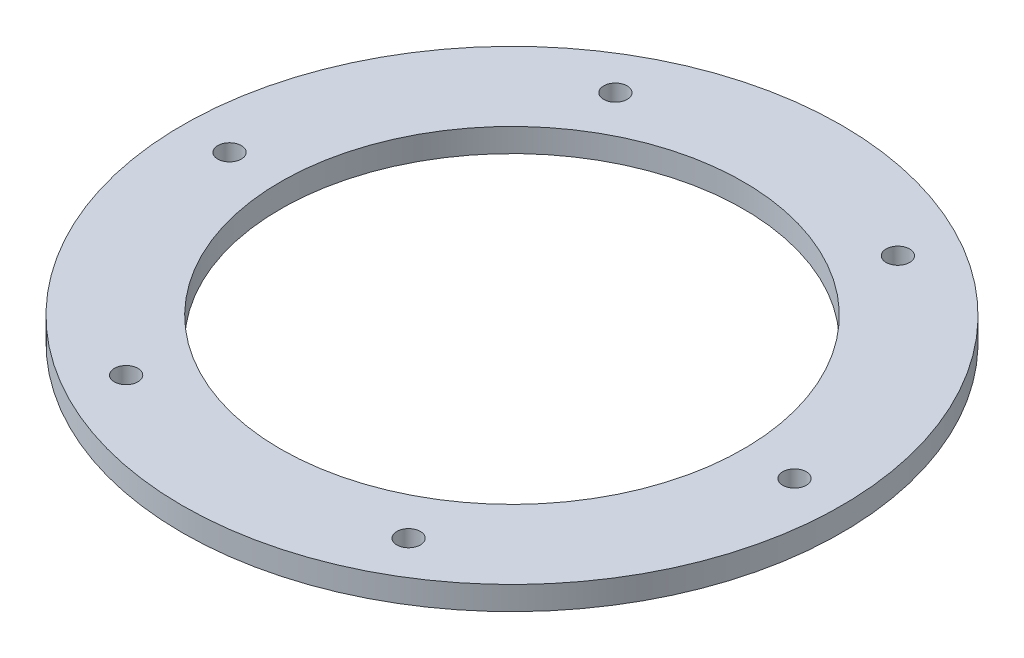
ISO-10303-21;
HEADER;
FILE_DESCRIPTION(('STEP AP214'),'2;1');
FILE_NAME('part.step','',(''),(''),'','','');
FILE_SCHEMA(('AUTOMOTIVE_DESIGN { 1 0 10303 214 1 1 1 1 }'));
ENDSEC;
DATA;
#1=APPLICATION_CONTEXT('core data for automotive mechanical design processes');
#2=APPLICATION_PROTOCOL_DEFINITION('international standard','automotive_design',2000,#1);
#3=PRODUCT_CONTEXT('',#1,'mechanical');
#4=PRODUCT('Part','Part','',(#3));
#5=PRODUCT_RELATED_PRODUCT_CATEGORY('part','',(#4));
#6=PRODUCT_DEFINITION_FORMATION('','',#4);
#7=PRODUCT_DEFINITION_CONTEXT('part definition',#1,'design');
#8=PRODUCT_DEFINITION('design','',#6,#7);
#9=PRODUCT_DEFINITION_SHAPE('','',#8);
#10=(LENGTH_UNIT() NAMED_UNIT(*) SI_UNIT(.MILLI.,.METRE.));
#11=(NAMED_UNIT(*) PLANE_ANGLE_UNIT() SI_UNIT($,.RADIAN.));
#12=(NAMED_UNIT(*) SI_UNIT($,.STERADIAN.) SOLID_ANGLE_UNIT());
#13=UNCERTAINTY_MEASURE_WITH_UNIT(LENGTH_MEASURE(1.E-05),#10,'distance_accuracy_value','');
#14=(GEOMETRIC_REPRESENTATION_CONTEXT(3) GLOBAL_UNCERTAINTY_ASSIGNED_CONTEXT((#13)) GLOBAL_UNIT_ASSIGNED_CONTEXT((#10,
#11,#12)) REPRESENTATION_CONTEXT('',''));
#15=CARTESIAN_POINT('',(0.,0.,0.));
#16=DIRECTION('',(0.,0.,1.));
#17=DIRECTION('',(1.,0.,0.));
#18=AXIS2_PLACEMENT_3D('',#15,#16,#17);
#19=CARTESIAN_POINT('',(0.,3.,0.));
#20=DIRECTION('',(0.,1.,0.));
#21=DIRECTION('',(0.,0.,1.));
#22=AXIS2_PLACEMENT_3D('',#19,#20,#21);
#23=PLANE('',#22);
#24=CARTESIAN_POINT('',(18.0000000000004,3.,31.1769145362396));
#25=DIRECTION('',(0.,1.,0.));
#26=DIRECTION('',(-0.866025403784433,0.,0.50000000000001));
#27=AXIS2_PLACEMENT_3D('',#24,#25,#26);
#28=CIRCLE('',#27,1.5);
#29=CARTESIAN_POINT('',(18.0000000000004,3.,32.6769145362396));
#30=VERTEX_POINT('',#29);
#31=EDGE_CURVE('E72',#30,#30,#28,.T.);
#32=ORIENTED_EDGE('',*,*,#31,.F.);
#33=EDGE_LOOP('',(#32));
#34=FACE_BOUND('',#33,.T.);
#35=CARTESIAN_POINT('',(-17.9999999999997,3.,31.17691453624));
#36=DIRECTION('',(0.,1.,0.));
#37=DIRECTION('',(-0.866025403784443,0.,-0.499999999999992));
#38=AXIS2_PLACEMENT_3D('',#35,#36,#37);
#39=CIRCLE('',#38,1.5);
#40=CARTESIAN_POINT('',(-17.9999999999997,3.,32.67691453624));
#41=VERTEX_POINT('',#40);
#42=EDGE_CURVE('E71',#41,#41,#39,.T.);
#43=ORIENTED_EDGE('',*,*,#42,.F.);
#44=EDGE_LOOP('',(#43));
#45=FACE_BOUND('',#44,.T.);
#46=CARTESIAN_POINT('',(-36.,3.,0.));
#47=DIRECTION('',(0.,1.,0.));
#48=DIRECTION('',(0.,0.,-1.));
#49=AXIS2_PLACEMENT_3D('',#46,#47,#48);
#50=CIRCLE('',#49,1.5);
#51=CARTESIAN_POINT('',(-36.,3.,1.5));
#52=VERTEX_POINT('',#51);
#53=EDGE_CURVE('E78',#52,#52,#50,.T.);
#54=ORIENTED_EDGE('',*,*,#53,.F.);
#55=EDGE_LOOP('',(#54));
#56=FACE_BOUND('',#55,.T.);
#57=CARTESIAN_POINT('',(-18.0000000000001,3.,-31.1769145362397));
#58=DIRECTION('',(0.,1.,0.));
#59=DIRECTION('',(0.866025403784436,0.,-0.500000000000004));
#60=AXIS2_PLACEMENT_3D('',#57,#58,#59);
#61=CIRCLE('',#60,1.5);
#62=CARTESIAN_POINT('',(-18.0000000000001,3.,-29.6769145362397));
#63=VERTEX_POINT('',#62);
#64=EDGE_CURVE('E84',#63,#63,#61,.T.);
#65=ORIENTED_EDGE('',*,*,#64,.F.);
#66=EDGE_LOOP('',(#65));
#67=FACE_BOUND('',#66,.T.);
#68=CARTESIAN_POINT('',(17.9999999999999,3.,-31.1769145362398));
#69=DIRECTION('',(0.,1.,0.));
#70=DIRECTION('',(0.86602540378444,0.,0.499999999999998));
#71=AXIS2_PLACEMENT_3D('',#68,#69,#70);
#72=CIRCLE('',#71,1.5);
#73=CARTESIAN_POINT('',(17.9999999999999,3.,-29.6769145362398));
#74=VERTEX_POINT('',#73);
#75=EDGE_CURVE('E64',#74,#74,#72,.T.);
#76=ORIENTED_EDGE('',*,*,#75,.F.);
#77=EDGE_LOOP('',(#76));
#78=FACE_BOUND('',#77,.T.);
#79=CARTESIAN_POINT('',(36.,3.,0.));
#80=DIRECTION('',(0.,1.,0.));
#81=DIRECTION('',(0.,0.,1.));
#82=AXIS2_PLACEMENT_3D('',#79,#80,#81);
#83=CIRCLE('',#82,1.5);
#84=CARTESIAN_POINT('',(36.,3.,1.5));
#85=VERTEX_POINT('',#84);
#86=EDGE_CURVE('E58',#85,#85,#83,.T.);
#87=ORIENTED_EDGE('',*,*,#86,.F.);
#88=EDGE_LOOP('',(#87));
#89=FACE_BOUND('',#88,.T.);
#90=CARTESIAN_POINT('',(0.,3.,0.));
#91=DIRECTION('',(0.,1.,0.));
#92=DIRECTION('',(0.,0.,1.));
#93=AXIS2_PLACEMENT_3D('',#90,#91,#92);
#94=CIRCLE('',#93,42.);
#95=CARTESIAN_POINT('',(0.,3.,42.));
#96=VERTEX_POINT('',#95);
#97=EDGE_CURVE('E10',#96,#96,#94,.T.);
#98=ORIENTED_EDGE('',*,*,#97,.T.);
#99=EDGE_LOOP('',(#98));
#100=FACE_BOUND('',#99,.T.);
#101=CARTESIAN_POINT('',(0.,3.,0.));
#102=DIRECTION('',(0.,1.,0.));
#103=DIRECTION('',(0.,0.,1.));
#104=AXIS2_PLACEMENT_3D('',#101,#102,#103);
#105=CIRCLE('',#104,29.5);
#106=CARTESIAN_POINT('',(0.,3.,29.5));
#107=VERTEX_POINT('',#106);
#108=EDGE_CURVE('E48',#107,#107,#105,.T.);
#109=ORIENTED_EDGE('',*,*,#108,.F.);
#110=EDGE_LOOP('',(#109));
#111=FACE_BOUND('',#110,.T.);
#112=ADVANCED_FACE('F37',(#34,#45,#56,#67,#78,#89,#100,#111),#23,.T.);
#113=CARTESIAN_POINT('',(0.,0.,0.));
#114=DIRECTION('',(0.,1.,0.));
#115=DIRECTION('',(0.,0.,1.));
#116=AXIS2_PLACEMENT_3D('',#113,#114,#115);
#117=PLANE('',#116);
#118=CARTESIAN_POINT('',(18.0000000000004,0.,31.1769145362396));
#119=DIRECTION('',(0.,1.,0.));
#120=DIRECTION('',(0.,0.,1.));
#121=AXIS2_PLACEMENT_3D('',#118,#119,#120);
#122=CIRCLE('',#121,1.5);
#123=CARTESIAN_POINT('',(18.0000000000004,0.,32.6769145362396));
#124=VERTEX_POINT('',#123);
#125=EDGE_CURVE('E68',#124,#124,#122,.F.);
#126=ORIENTED_EDGE('',*,*,#125,.F.);
#127=EDGE_LOOP('',(#126));
#128=FACE_BOUND('',#127,.T.);
#129=CARTESIAN_POINT('',(-17.9999999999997,0.,31.17691453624));
#130=DIRECTION('',(0.,1.,0.));
#131=DIRECTION('',(0.,0.,1.));
#132=AXIS2_PLACEMENT_3D('',#129,#130,#131);
#133=CIRCLE('',#132,1.5);
#134=CARTESIAN_POINT('',(-17.9999999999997,0.,32.67691453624));
#135=VERTEX_POINT('',#134);
#136=EDGE_CURVE('E75',#135,#135,#133,.F.);
#137=ORIENTED_EDGE('',*,*,#136,.F.);
#138=EDGE_LOOP('',(#137));
#139=FACE_BOUND('',#138,.T.);
#140=CARTESIAN_POINT('',(-36.,0.,0.));
#141=DIRECTION('',(0.,1.,0.));
#142=DIRECTION('',(0.,0.,1.));
#143=AXIS2_PLACEMENT_3D('',#140,#141,#142);
#144=CIRCLE('',#143,1.5);
#145=CARTESIAN_POINT('',(-36.,0.,1.5));
#146=VERTEX_POINT('',#145);
#147=EDGE_CURVE('E81',#146,#146,#144,.F.);
#148=ORIENTED_EDGE('',*,*,#147,.F.);
#149=EDGE_LOOP('',(#148));
#150=FACE_BOUND('',#149,.T.);
#151=CARTESIAN_POINT('',(-18.0000000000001,0.,-31.1769145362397));
#152=DIRECTION('',(0.,1.,0.));
#153=DIRECTION('',(0.,0.,1.));
#154=AXIS2_PLACEMENT_3D('',#151,#152,#153);
#155=CIRCLE('',#154,1.5);
#156=CARTESIAN_POINT('',(-18.0000000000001,0.,-29.6769145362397));
#157=VERTEX_POINT('',#156);
#158=EDGE_CURVE('E67',#157,#157,#155,.F.);
#159=ORIENTED_EDGE('',*,*,#158,.F.);
#160=EDGE_LOOP('',(#159));
#161=FACE_BOUND('',#160,.T.);
#162=CARTESIAN_POINT('',(17.9999999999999,0.,-31.1769145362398));
#163=DIRECTION('',(0.,1.,0.));
#164=DIRECTION('',(0.,0.,1.));
#165=AXIS2_PLACEMENT_3D('',#162,#163,#164);
#166=CIRCLE('',#165,1.5);
#167=CARTESIAN_POINT('',(17.9999999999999,0.,-29.6769145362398));
#168=VERTEX_POINT('',#167);
#169=EDGE_CURVE('E61',#168,#168,#166,.F.);
#170=ORIENTED_EDGE('',*,*,#169,.F.);
#171=EDGE_LOOP('',(#170));
#172=FACE_BOUND('',#171,.T.);
#173=CARTESIAN_POINT('',(36.,0.,0.));
#174=DIRECTION('',(0.,1.,0.));
#175=DIRECTION('',(0.,0.,1.));
#176=AXIS2_PLACEMENT_3D('',#173,#174,#175);
#177=CIRCLE('',#176,1.5);
#178=CARTESIAN_POINT('',(36.,0.,1.5));
#179=VERTEX_POINT('',#178);
#180=EDGE_CURVE('E53',#179,#179,#177,.F.);
#181=ORIENTED_EDGE('',*,*,#180,.F.);
#182=EDGE_LOOP('',(#181));
#183=FACE_BOUND('',#182,.T.);
#184=CARTESIAN_POINT('',(0.,0.,0.));
#185=DIRECTION('',(0.,1.,0.));
#186=DIRECTION('',(0.,0.,1.));
#187=AXIS2_PLACEMENT_3D('',#184,#185,#186);
#188=CIRCLE('',#187,42.);
#189=CARTESIAN_POINT('',(0.,0.,42.));
#190=VERTEX_POINT('',#189);
#191=EDGE_CURVE('E41',#190,#190,#188,.T.);
#192=ORIENTED_EDGE('',*,*,#191,.F.);
#193=EDGE_LOOP('',(#192));
#194=FACE_BOUND('',#193,.T.);
#195=CARTESIAN_POINT('',(0.,0.,0.));
#196=DIRECTION('',(0.,1.,0.));
#197=DIRECTION('',(0.,0.,1.));
#198=AXIS2_PLACEMENT_3D('',#195,#196,#197);
#199=CIRCLE('',#198,29.5);
#200=CARTESIAN_POINT('',(0.,0.,29.5));
#201=VERTEX_POINT('',#200);
#202=EDGE_CURVE('E50',#201,#201,#199,.T.);
#203=ORIENTED_EDGE('',*,*,#202,.T.);
#204=EDGE_LOOP('',(#203));
#205=FACE_BOUND('',#204,.T.);
#206=ADVANCED_FACE('F97',(#128,#139,#150,#161,#172,#183,#194,#205),#117,.F.);
#207=CARTESIAN_POINT('',(0.,3.,0.));
#208=DIRECTION('',(0.,-1.,0.));
#209=DIRECTION('',(0.,0.,-1.));
#210=AXIS2_PLACEMENT_3D('',#207,#208,#209);
#211=CYLINDRICAL_SURFACE('',#210,42.);
#212=ORIENTED_EDGE('',*,*,#97,.F.);
#213=EDGE_LOOP('',(#212));
#214=FACE_BOUND('',#213,.T.);
#215=ORIENTED_EDGE('',*,*,#191,.T.);
#216=EDGE_LOOP('',(#215));
#217=FACE_BOUND('',#216,.T.);
#218=ADVANCED_FACE('F39',(#214,#217),#211,.T.);
#219=CARTESIAN_POINT('',(0.,3.,0.));
#220=DIRECTION('',(0.,-1.,0.));
#221=DIRECTION('',(0.,0.,-1.));
#222=AXIS2_PLACEMENT_3D('',#219,#220,#221);
#223=CYLINDRICAL_SURFACE('',#222,29.5);
#224=ORIENTED_EDGE('',*,*,#108,.T.);
#225=EDGE_LOOP('',(#224));
#226=FACE_BOUND('',#225,.T.);
#227=ORIENTED_EDGE('',*,*,#202,.F.);
#228=EDGE_LOOP('',(#227));
#229=FACE_BOUND('',#228,.T.);
#230=ADVANCED_FACE('F106',(#226,#229),#223,.F.);
#231=CARTESIAN_POINT('',(36.,-0.00100000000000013,0.));
#232=DIRECTION('',(0.,1.,0.));
#233=DIRECTION('',(0.,0.,1.));
#234=AXIS2_PLACEMENT_3D('',#231,#232,#233);
#235=CYLINDRICAL_SURFACE('',#234,1.5);
#236=CARTESIAN_POINT('',(36.,3.,1.5));
#237=CARTESIAN_POINT('',(36.,2.96875,1.5));
#238=CARTESIAN_POINT('',(36.,2.9375,1.5));
#239=CARTESIAN_POINT('',(36.,2.875,1.5));
#240=CARTESIAN_POINT('',(36.,2.84375,1.5));
#241=CARTESIAN_POINT('',(36.,2.78125,1.5));
#242=CARTESIAN_POINT('',(36.,2.75,1.5));
#243=CARTESIAN_POINT('',(36.,2.6875,1.5));
#244=CARTESIAN_POINT('',(36.,2.65625,1.5));
#245=CARTESIAN_POINT('',(36.,2.59375,1.5));
#246=CARTESIAN_POINT('',(36.,2.5625,1.5));
#247=CARTESIAN_POINT('',(36.,2.5,1.5));
#248=CARTESIAN_POINT('',(36.,2.46875,1.5));
#249=CARTESIAN_POINT('',(36.,2.40625,1.5));
#250=CARTESIAN_POINT('',(36.,2.375,1.5));
#251=CARTESIAN_POINT('',(36.,2.3125,1.5));
#252=CARTESIAN_POINT('',(36.,2.28125,1.5));
#253=CARTESIAN_POINT('',(36.,2.21875,1.5));
#254=CARTESIAN_POINT('',(36.,2.1875,1.5));
#255=CARTESIAN_POINT('',(36.,2.125,1.5));
#256=CARTESIAN_POINT('',(36.,2.09375,1.5));
#257=CARTESIAN_POINT('',(36.,2.03125,1.5));
#258=CARTESIAN_POINT('',(36.,2.,1.5));
#259=CARTESIAN_POINT('',(36.,1.9375,1.5));
#260=CARTESIAN_POINT('',(36.,1.90625,1.5));
#261=CARTESIAN_POINT('',(36.,1.84375,1.5));
#262=CARTESIAN_POINT('',(36.,1.8125,1.5));
#263=CARTESIAN_POINT('',(36.,1.75,1.5));
#264=CARTESIAN_POINT('',(36.,1.71875,1.5));
#265=CARTESIAN_POINT('',(36.,1.65625,1.5));
#266=CARTESIAN_POINT('',(36.,1.625,1.5));
#267=CARTESIAN_POINT('',(36.,1.5625,1.5));
#268=CARTESIAN_POINT('',(36.,1.53125,1.5));
#269=CARTESIAN_POINT('',(36.,1.46875,1.5));
#270=CARTESIAN_POINT('',(36.,1.4375,1.5));
#271=CARTESIAN_POINT('',(36.,1.375,1.5));
#272=CARTESIAN_POINT('',(36.,1.34375,1.5));
#273=CARTESIAN_POINT('',(36.,1.28125,1.5));
#274=CARTESIAN_POINT('',(36.,1.25,1.5));
#275=CARTESIAN_POINT('',(36.,1.1875,1.5));
#276=CARTESIAN_POINT('',(36.,1.15625,1.5));
#277=CARTESIAN_POINT('',(36.,1.09375,1.5));
#278=CARTESIAN_POINT('',(36.,1.0625,1.5));
#279=CARTESIAN_POINT('',(36.,1.,1.5));
#280=CARTESIAN_POINT('',(36.,0.96875,1.5));
#281=CARTESIAN_POINT('',(36.,0.90625,1.5));
#282=CARTESIAN_POINT('',(36.,0.875,1.5));
#283=CARTESIAN_POINT('',(36.,0.8125,1.5));
#284=CARTESIAN_POINT('',(36.,0.78125,1.5));
#285=CARTESIAN_POINT('',(36.,0.71875,1.5));
#286=CARTESIAN_POINT('',(36.,0.6875,1.5));
#287=CARTESIAN_POINT('',(36.,0.625,1.5));
#288=CARTESIAN_POINT('',(36.,0.59375,1.5));
#289=CARTESIAN_POINT('',(36.,0.53125,1.5));
#290=CARTESIAN_POINT('',(36.,0.5,1.5));
#291=CARTESIAN_POINT('',(36.,0.4375,1.5));
#292=CARTESIAN_POINT('',(36.,0.40625,1.5));
#293=CARTESIAN_POINT('',(36.,0.34375,1.5));
#294=CARTESIAN_POINT('',(36.,0.3125,1.5));
#295=CARTESIAN_POINT('',(36.,0.25,1.5));
#296=CARTESIAN_POINT('',(36.,0.21875,1.5));
#297=CARTESIAN_POINT('',(36.,0.15625,1.5));
#298=CARTESIAN_POINT('',(36.,0.125,1.5));
#299=CARTESIAN_POINT('',(36.,0.0625000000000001,1.5));
#300=CARTESIAN_POINT('',(36.,0.0312500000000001,1.5));
#301=CARTESIAN_POINT('',(36.,0.,1.5));
#302=B_SPLINE_CURVE_WITH_KNOTS('',3,(#236,#237,#238,#239,#240,#241,#242,#243,#244,#245,#246,
#247,#248,#249,#250,#251,#252,#253,#254,#255,#256,#257,#258,#259,#260,#261,#262,#263,#264,#265,
#266,#267,#268,#269,#270,#271,#272,#273,#274,#275,#276,#277,#278,#279,#280,#281,#282,#283,#284,
#285,#286,#287,#288,#289,#290,#291,#292,#293,#294,#295,#296,#297,#298,#299,#300,#301),
.UNSPECIFIED.,.F.,.F.,(4,2,2,2,2,2,2,2,2,2,2,2,2,2,2,2,2,2,2,2,2,2,2,2,2,2,2,2,2,2,2,2,4),(0.,
0.0937500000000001,0.1875,0.28125,0.375,0.46875,0.5625,0.65625,0.75,0.84375,0.9375,1.03125,
1.125,1.21875,1.3125,1.40625,1.5,1.59375,1.6875,1.78125,1.875,1.96875,2.0625,2.15625,2.25,
2.34375,2.4375,2.53125,2.625,2.71875,2.8125,2.90625,3.),.UNSPECIFIED.);
#303=EDGE_CURVE('BSEAM109',#85,#179,#302,.T.);
#304=ORIENTED_EDGE('',*,*,#86,.T.);
#305=ORIENTED_EDGE('',*,*,#180,.T.);
#306=ORIENTED_EDGE('',*,*,#303,.T.);
#307=ORIENTED_EDGE('',*,*,#303,.F.);
#308=EDGE_LOOP('',(#304,#306,#305,#307));
#309=FACE_BOUND('',#308,.T.);
#310=ADVANCED_FACE('F109',(#309),#235,.F.);
#311=CARTESIAN_POINT('',(17.9999999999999,-0.00100000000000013,-31.1769145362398));
#312=DIRECTION('',(0.,1.,0.));
#313=DIRECTION('',(0.,0.,1.));
#314=AXIS2_PLACEMENT_3D('',#311,#312,#313);
#315=CYLINDRICAL_SURFACE('',#314,1.5);
#316=CARTESIAN_POINT('',(17.9999999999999,3.,-29.6769145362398));
#317=CARTESIAN_POINT('',(17.9999999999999,2.96875,-29.6769145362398));
#318=CARTESIAN_POINT('',(17.9999999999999,2.9375,-29.6769145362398));
#319=CARTESIAN_POINT('',(17.9999999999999,2.875,-29.6769145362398));
#320=CARTESIAN_POINT('',(17.9999999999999,2.84375,-29.6769145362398));
#321=CARTESIAN_POINT('',(17.9999999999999,2.78125,-29.6769145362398));
#322=CARTESIAN_POINT('',(17.9999999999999,2.75,-29.6769145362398));
#323=CARTESIAN_POINT('',(17.9999999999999,2.6875,-29.6769145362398));
#324=CARTESIAN_POINT('',(17.9999999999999,2.65625,-29.6769145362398));
#325=CARTESIAN_POINT('',(17.9999999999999,2.59375,-29.6769145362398));
#326=CARTESIAN_POINT('',(17.9999999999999,2.5625,-29.6769145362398));
#327=CARTESIAN_POINT('',(17.9999999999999,2.5,-29.6769145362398));
#328=CARTESIAN_POINT('',(17.9999999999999,2.46875,-29.6769145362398));
#329=CARTESIAN_POINT('',(17.9999999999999,2.40625,-29.6769145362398));
#330=CARTESIAN_POINT('',(17.9999999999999,2.375,-29.6769145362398));
#331=CARTESIAN_POINT('',(17.9999999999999,2.3125,-29.6769145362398));
#332=CARTESIAN_POINT('',(17.9999999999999,2.28125,-29.6769145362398));
#333=CARTESIAN_POINT('',(17.9999999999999,2.21875,-29.6769145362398));
#334=CARTESIAN_POINT('',(17.9999999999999,2.1875,-29.6769145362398));
#335=CARTESIAN_POINT('',(17.9999999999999,2.125,-29.6769145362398));
#336=CARTESIAN_POINT('',(17.9999999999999,2.09375,-29.6769145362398));
#337=CARTESIAN_POINT('',(17.9999999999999,2.03125,-29.6769145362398));
#338=CARTESIAN_POINT('',(17.9999999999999,2.,-29.6769145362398));
#339=CARTESIAN_POINT('',(17.9999999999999,1.9375,-29.6769145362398));
#340=CARTESIAN_POINT('',(17.9999999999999,1.90625,-29.6769145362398));
#341=CARTESIAN_POINT('',(17.9999999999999,1.84375,-29.6769145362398));
#342=CARTESIAN_POINT('',(17.9999999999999,1.8125,-29.6769145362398));
#343=CARTESIAN_POINT('',(17.9999999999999,1.75,-29.6769145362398));
#344=CARTESIAN_POINT('',(17.9999999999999,1.71875,-29.6769145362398));
#345=CARTESIAN_POINT('',(17.9999999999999,1.65625,-29.6769145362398));
#346=CARTESIAN_POINT('',(17.9999999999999,1.625,-29.6769145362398));
#347=CARTESIAN_POINT('',(17.9999999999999,1.5625,-29.6769145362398));
#348=CARTESIAN_POINT('',(17.9999999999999,1.53125,-29.6769145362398));
#349=CARTESIAN_POINT('',(17.9999999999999,1.46875,-29.6769145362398));
#350=CARTESIAN_POINT('',(17.9999999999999,1.4375,-29.6769145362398));
#351=CARTESIAN_POINT('',(17.9999999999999,1.375,-29.6769145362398));
#352=CARTESIAN_POINT('',(17.9999999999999,1.34375,-29.6769145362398));
#353=CARTESIAN_POINT('',(17.9999999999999,1.28125,-29.6769145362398));
#354=CARTESIAN_POINT('',(17.9999999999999,1.25,-29.6769145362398));
#355=CARTESIAN_POINT('',(17.9999999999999,1.1875,-29.6769145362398));
#356=CARTESIAN_POINT('',(17.9999999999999,1.15625,-29.6769145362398));
#357=CARTESIAN_POINT('',(17.9999999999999,1.09375,-29.6769145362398));
#358=CARTESIAN_POINT('',(17.9999999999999,1.0625,-29.6769145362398));
#359=CARTESIAN_POINT('',(17.9999999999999,1.,-29.6769145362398));
#360=CARTESIAN_POINT('',(17.9999999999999,0.96875,-29.6769145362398));
#361=CARTESIAN_POINT('',(17.9999999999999,0.90625,-29.6769145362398));
#362=CARTESIAN_POINT('',(17.9999999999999,0.875,-29.6769145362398));
#363=CARTESIAN_POINT('',(17.9999999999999,0.8125,-29.6769145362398));
#364=CARTESIAN_POINT('',(17.9999999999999,0.78125,-29.6769145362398));
#365=CARTESIAN_POINT('',(17.9999999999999,0.71875,-29.6769145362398));
#366=CARTESIAN_POINT('',(17.9999999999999,0.6875,-29.6769145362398));
#367=CARTESIAN_POINT('',(17.9999999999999,0.625,-29.6769145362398));
#368=CARTESIAN_POINT('',(17.9999999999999,0.59375,-29.6769145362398));
#369=CARTESIAN_POINT('',(17.9999999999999,0.53125,-29.6769145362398));
#370=CARTESIAN_POINT('',(17.9999999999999,0.5,-29.6769145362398));
#371=CARTESIAN_POINT('',(17.9999999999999,0.4375,-29.6769145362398));
#372=CARTESIAN_POINT('',(17.9999999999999,0.40625,-29.6769145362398));
#373=CARTESIAN_POINT('',(17.9999999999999,0.34375,-29.6769145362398));
#374=CARTESIAN_POINT('',(17.9999999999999,0.3125,-29.6769145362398));
#375=CARTESIAN_POINT('',(17.9999999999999,0.25,-29.6769145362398));
#376=CARTESIAN_POINT('',(17.9999999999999,0.21875,-29.6769145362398));
#377=CARTESIAN_POINT('',(17.9999999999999,0.15625,-29.6769145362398));
#378=CARTESIAN_POINT('',(17.9999999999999,0.125,-29.6769145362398));
#379=CARTESIAN_POINT('',(17.9999999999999,0.0625000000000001,-29.6769145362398));
#380=CARTESIAN_POINT('',(17.9999999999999,0.0312500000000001,-29.6769145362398));
#381=CARTESIAN_POINT('',(17.9999999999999,0.,-29.6769145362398));
#382=B_SPLINE_CURVE_WITH_KNOTS('',3,(#316,#317,#318,#319,#320,#321,#322,#323,#324,#325,#326,
#327,#328,#329,#330,#331,#332,#333,#334,#335,#336,#337,#338,#339,#340,#341,#342,#343,#344,#345,
#346,#347,#348,#349,#350,#351,#352,#353,#354,#355,#356,#357,#358,#359,#360,#361,#362,#363,#364,
#365,#366,#367,#368,#369,#370,#371,#372,#373,#374,#375,#376,#377,#378,#379,#380,#381),
.UNSPECIFIED.,.F.,.F.,(4,2,2,2,2,2,2,2,2,2,2,2,2,2,2,2,2,2,2,2,2,2,2,2,2,2,2,2,2,2,2,2,4),(0.,
0.0937500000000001,0.1875,0.28125,0.375,0.46875,0.5625,0.65625,0.75,0.84375,0.9375,1.03125,
1.125,1.21875,1.3125,1.40625,1.5,1.59375,1.6875,1.78125,1.875,1.96875,2.0625,2.15625,2.25,
2.34375,2.4375,2.53125,2.625,2.71875,2.8125,2.90625,3.),.UNSPECIFIED.);
#383=EDGE_CURVE('BSEAM125',#74,#168,#382,.T.);
#384=ORIENTED_EDGE('',*,*,#75,.T.);
#385=ORIENTED_EDGE('',*,*,#169,.T.);
#386=ORIENTED_EDGE('',*,*,#383,.T.);
#387=ORIENTED_EDGE('',*,*,#383,.F.);
#388=EDGE_LOOP('',(#384,#386,#385,#387));
#389=FACE_BOUND('',#388,.T.);
#390=ADVANCED_FACE('F125',(#389),#315,.F.);
#391=CARTESIAN_POINT('',(-18.0000000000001,-0.00100000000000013,-31.1769145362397));
#392=DIRECTION('',(0.,1.,0.));
#393=DIRECTION('',(0.,0.,1.));
#394=AXIS2_PLACEMENT_3D('',#391,#392,#393);
#395=CYLINDRICAL_SURFACE('',#394,1.5);
#396=CARTESIAN_POINT('',(-18.0000000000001,3.,-29.6769145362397));
#397=CARTESIAN_POINT('',(-18.0000000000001,2.96875,-29.6769145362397));
#398=CARTESIAN_POINT('',(-18.0000000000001,2.9375,-29.6769145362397));
#399=CARTESIAN_POINT('',(-18.0000000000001,2.875,-29.6769145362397));
#400=CARTESIAN_POINT('',(-18.0000000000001,2.84375,-29.6769145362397));
#401=CARTESIAN_POINT('',(-18.0000000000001,2.78125,-29.6769145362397));
#402=CARTESIAN_POINT('',(-18.0000000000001,2.75,-29.6769145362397));
#403=CARTESIAN_POINT('',(-18.0000000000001,2.6875,-29.6769145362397));
#404=CARTESIAN_POINT('',(-18.0000000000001,2.65625,-29.6769145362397));
#405=CARTESIAN_POINT('',(-18.0000000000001,2.59375,-29.6769145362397));
#406=CARTESIAN_POINT('',(-18.0000000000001,2.5625,-29.6769145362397));
#407=CARTESIAN_POINT('',(-18.0000000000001,2.5,-29.6769145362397));
#408=CARTESIAN_POINT('',(-18.0000000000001,2.46875,-29.6769145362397));
#409=CARTESIAN_POINT('',(-18.0000000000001,2.40625,-29.6769145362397));
#410=CARTESIAN_POINT('',(-18.0000000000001,2.375,-29.6769145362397));
#411=CARTESIAN_POINT('',(-18.0000000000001,2.3125,-29.6769145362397));
#412=CARTESIAN_POINT('',(-18.0000000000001,2.28125,-29.6769145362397));
#413=CARTESIAN_POINT('',(-18.0000000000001,2.21875,-29.6769145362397));
#414=CARTESIAN_POINT('',(-18.0000000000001,2.1875,-29.6769145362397));
#415=CARTESIAN_POINT('',(-18.0000000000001,2.125,-29.6769145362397));
#416=CARTESIAN_POINT('',(-18.0000000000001,2.09375,-29.6769145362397));
#417=CARTESIAN_POINT('',(-18.0000000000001,2.03125,-29.6769145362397));
#418=CARTESIAN_POINT('',(-18.0000000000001,2.,-29.6769145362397));
#419=CARTESIAN_POINT('',(-18.0000000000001,1.9375,-29.6769145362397));
#420=CARTESIAN_POINT('',(-18.0000000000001,1.90625,-29.6769145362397));
#421=CARTESIAN_POINT('',(-18.0000000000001,1.84375,-29.6769145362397));
#422=CARTESIAN_POINT('',(-18.0000000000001,1.8125,-29.6769145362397));
#423=CARTESIAN_POINT('',(-18.0000000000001,1.75,-29.6769145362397));
#424=CARTESIAN_POINT('',(-18.0000000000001,1.71875,-29.6769145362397));
#425=CARTESIAN_POINT('',(-18.0000000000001,1.65625,-29.6769145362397));
#426=CARTESIAN_POINT('',(-18.0000000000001,1.625,-29.6769145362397));
#427=CARTESIAN_POINT('',(-18.0000000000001,1.5625,-29.6769145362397));
#428=CARTESIAN_POINT('',(-18.0000000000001,1.53125,-29.6769145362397));
#429=CARTESIAN_POINT('',(-18.0000000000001,1.46875,-29.6769145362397));
#430=CARTESIAN_POINT('',(-18.0000000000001,1.4375,-29.6769145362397));
#431=CARTESIAN_POINT('',(-18.0000000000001,1.375,-29.6769145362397));
#432=CARTESIAN_POINT('',(-18.0000000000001,1.34375,-29.6769145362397));
#433=CARTESIAN_POINT('',(-18.0000000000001,1.28125,-29.6769145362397));
#434=CARTESIAN_POINT('',(-18.0000000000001,1.25,-29.6769145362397));
#435=CARTESIAN_POINT('',(-18.0000000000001,1.1875,-29.6769145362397));
#436=CARTESIAN_POINT('',(-18.0000000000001,1.15625,-29.6769145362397));
#437=CARTESIAN_POINT('',(-18.0000000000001,1.09375,-29.6769145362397));
#438=CARTESIAN_POINT('',(-18.0000000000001,1.0625,-29.6769145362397));
#439=CARTESIAN_POINT('',(-18.0000000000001,1.,-29.6769145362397));
#440=CARTESIAN_POINT('',(-18.0000000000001,0.96875,-29.6769145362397));
#441=CARTESIAN_POINT('',(-18.0000000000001,0.90625,-29.6769145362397));
#442=CARTESIAN_POINT('',(-18.0000000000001,0.875,-29.6769145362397));
#443=CARTESIAN_POINT('',(-18.0000000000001,0.8125,-29.6769145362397));
#444=CARTESIAN_POINT('',(-18.0000000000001,0.78125,-29.6769145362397));
#445=CARTESIAN_POINT('',(-18.0000000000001,0.71875,-29.6769145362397));
#446=CARTESIAN_POINT('',(-18.0000000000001,0.6875,-29.6769145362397));
#447=CARTESIAN_POINT('',(-18.0000000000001,0.625,-29.6769145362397));
#448=CARTESIAN_POINT('',(-18.0000000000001,0.59375,-29.6769145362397));
#449=CARTESIAN_POINT('',(-18.0000000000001,0.53125,-29.6769145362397));
#450=CARTESIAN_POINT('',(-18.0000000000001,0.5,-29.6769145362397));
#451=CARTESIAN_POINT('',(-18.0000000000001,0.4375,-29.6769145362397));
#452=CARTESIAN_POINT('',(-18.0000000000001,0.40625,-29.6769145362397));
#453=CARTESIAN_POINT('',(-18.0000000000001,0.34375,-29.6769145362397));
#454=CARTESIAN_POINT('',(-18.0000000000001,0.3125,-29.6769145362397));
#455=CARTESIAN_POINT('',(-18.0000000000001,0.25,-29.6769145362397));
#456=CARTESIAN_POINT('',(-18.0000000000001,0.21875,-29.6769145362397));
#457=CARTESIAN_POINT('',(-18.0000000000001,0.15625,-29.6769145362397));
#458=CARTESIAN_POINT('',(-18.0000000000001,0.125,-29.6769145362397));
#459=CARTESIAN_POINT('',(-18.0000000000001,0.0625000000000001,-29.6769145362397));
#460=CARTESIAN_POINT('',(-18.0000000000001,0.0312500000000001,-29.6769145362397));
#461=CARTESIAN_POINT('',(-18.0000000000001,0.,-29.6769145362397));
#462=B_SPLINE_CURVE_WITH_KNOTS('',3,(#396,#397,#398,#399,#400,#401,#402,#403,#404,#405,#406,
#407,#408,#409,#410,#411,#412,#413,#414,#415,#416,#417,#418,#419,#420,#421,#422,#423,#424,#425,
#426,#427,#428,#429,#430,#431,#432,#433,#434,#435,#436,#437,#438,#439,#440,#441,#442,#443,#444,
#445,#446,#447,#448,#449,#450,#451,#452,#453,#454,#455,#456,#457,#458,#459,#460,#461),
.UNSPECIFIED.,.F.,.F.,(4,2,2,2,2,2,2,2,2,2,2,2,2,2,2,2,2,2,2,2,2,2,2,2,2,2,2,2,2,2,2,2,4),(0.,
0.0937500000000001,0.1875,0.28125,0.375,0.46875,0.5625,0.65625,0.75,0.84375,0.9375,1.03125,
1.125,1.21875,1.3125,1.40625,1.5,1.59375,1.6875,1.78125,1.875,1.96875,2.0625,2.15625,2.25,
2.34375,2.4375,2.53125,2.625,2.71875,2.8125,2.90625,3.),.UNSPECIFIED.);
#463=EDGE_CURVE('BSEAM92',#63,#157,#462,.T.);
#464=ORIENTED_EDGE('',*,*,#64,.T.);
#465=ORIENTED_EDGE('',*,*,#158,.T.);
#466=ORIENTED_EDGE('',*,*,#463,.T.);
#467=ORIENTED_EDGE('',*,*,#463,.F.);
#468=EDGE_LOOP('',(#464,#466,#465,#467));
#469=FACE_BOUND('',#468,.T.);
#470=ADVANCED_FACE('F92',(#469),#395,.F.);
#471=CARTESIAN_POINT('',(-36.,-0.00100000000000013,0.));
#472=DIRECTION('',(0.,1.,0.));
#473=DIRECTION('',(0.,0.,1.));
#474=AXIS2_PLACEMENT_3D('',#471,#472,#473);
#475=CYLINDRICAL_SURFACE('',#474,1.5);
#476=CARTESIAN_POINT('',(-36.,3.,1.5));
#477=CARTESIAN_POINT('',(-36.,2.96875,1.5));
#478=CARTESIAN_POINT('',(-36.,2.9375,1.5));
#479=CARTESIAN_POINT('',(-36.,2.875,1.5));
#480=CARTESIAN_POINT('',(-36.,2.84375,1.5));
#481=CARTESIAN_POINT('',(-36.,2.78125,1.5));
#482=CARTESIAN_POINT('',(-36.,2.75,1.5));
#483=CARTESIAN_POINT('',(-36.,2.6875,1.5));
#484=CARTESIAN_POINT('',(-36.,2.65625,1.5));
#485=CARTESIAN_POINT('',(-36.,2.59375,1.5));
#486=CARTESIAN_POINT('',(-36.,2.5625,1.5));
#487=CARTESIAN_POINT('',(-36.,2.5,1.5));
#488=CARTESIAN_POINT('',(-36.,2.46875,1.5));
#489=CARTESIAN_POINT('',(-36.,2.40625,1.5));
#490=CARTESIAN_POINT('',(-36.,2.375,1.5));
#491=CARTESIAN_POINT('',(-36.,2.3125,1.5));
#492=CARTESIAN_POINT('',(-36.,2.28125,1.5));
#493=CARTESIAN_POINT('',(-36.,2.21875,1.5));
#494=CARTESIAN_POINT('',(-36.,2.1875,1.5));
#495=CARTESIAN_POINT('',(-36.,2.125,1.5));
#496=CARTESIAN_POINT('',(-36.,2.09375,1.5));
#497=CARTESIAN_POINT('',(-36.,2.03125,1.5));
#498=CARTESIAN_POINT('',(-36.,2.,1.5));
#499=CARTESIAN_POINT('',(-36.,1.9375,1.5));
#500=CARTESIAN_POINT('',(-36.,1.90625,1.5));
#501=CARTESIAN_POINT('',(-36.,1.84375,1.5));
#502=CARTESIAN_POINT('',(-36.,1.8125,1.5));
#503=CARTESIAN_POINT('',(-36.,1.75,1.5));
#504=CARTESIAN_POINT('',(-36.,1.71875,1.5));
#505=CARTESIAN_POINT('',(-36.,1.65625,1.5));
#506=CARTESIAN_POINT('',(-36.,1.625,1.5));
#507=CARTESIAN_POINT('',(-36.,1.5625,1.5));
#508=CARTESIAN_POINT('',(-36.,1.53125,1.5));
#509=CARTESIAN_POINT('',(-36.,1.46875,1.5));
#510=CARTESIAN_POINT('',(-36.,1.4375,1.5));
#511=CARTESIAN_POINT('',(-36.,1.375,1.5));
#512=CARTESIAN_POINT('',(-36.,1.34375,1.5));
#513=CARTESIAN_POINT('',(-36.,1.28125,1.5));
#514=CARTESIAN_POINT('',(-36.,1.25,1.5));
#515=CARTESIAN_POINT('',(-36.,1.1875,1.5));
#516=CARTESIAN_POINT('',(-36.,1.15625,1.5));
#517=CARTESIAN_POINT('',(-36.,1.09375,1.5));
#518=CARTESIAN_POINT('',(-36.,1.0625,1.5));
#519=CARTESIAN_POINT('',(-36.,1.,1.5));
#520=CARTESIAN_POINT('',(-36.,0.96875,1.5));
#521=CARTESIAN_POINT('',(-36.,0.90625,1.5));
#522=CARTESIAN_POINT('',(-36.,0.875,1.5));
#523=CARTESIAN_POINT('',(-36.,0.8125,1.5));
#524=CARTESIAN_POINT('',(-36.,0.78125,1.5));
#525=CARTESIAN_POINT('',(-36.,0.71875,1.5));
#526=CARTESIAN_POINT('',(-36.,0.6875,1.5));
#527=CARTESIAN_POINT('',(-36.,0.625,1.5));
#528=CARTESIAN_POINT('',(-36.,0.59375,1.5));
#529=CARTESIAN_POINT('',(-36.,0.53125,1.5));
#530=CARTESIAN_POINT('',(-36.,0.5,1.5));
#531=CARTESIAN_POINT('',(-36.,0.4375,1.5));
#532=CARTESIAN_POINT('',(-36.,0.40625,1.5));
#533=CARTESIAN_POINT('',(-36.,0.34375,1.5));
#534=CARTESIAN_POINT('',(-36.,0.3125,1.5));
#535=CARTESIAN_POINT('',(-36.,0.25,1.5));
#536=CARTESIAN_POINT('',(-36.,0.21875,1.5));
#537=CARTESIAN_POINT('',(-36.,0.15625,1.5));
#538=CARTESIAN_POINT('',(-36.,0.125,1.5));
#539=CARTESIAN_POINT('',(-36.,0.0625000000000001,1.5));
#540=CARTESIAN_POINT('',(-36.,0.0312500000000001,1.5));
#541=CARTESIAN_POINT('',(-36.,0.,1.5));
#542=B_SPLINE_CURVE_WITH_KNOTS('',3,(#476,#477,#478,#479,#480,#481,#482,#483,#484,#485,#486,
#487,#488,#489,#490,#491,#492,#493,#494,#495,#496,#497,#498,#499,#500,#501,#502,#503,#504,#505,
#506,#507,#508,#509,#510,#511,#512,#513,#514,#515,#516,#517,#518,#519,#520,#521,#522,#523,#524,
#525,#526,#527,#528,#529,#530,#531,#532,#533,#534,#535,#536,#537,#538,#539,#540,#541),
.UNSPECIFIED.,.F.,.F.,(4,2,2,2,2,2,2,2,2,2,2,2,2,2,2,2,2,2,2,2,2,2,2,2,2,2,2,2,2,2,2,2,4),(0.,
0.0937500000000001,0.1875,0.28125,0.375,0.46875,0.5625,0.65625,0.75,0.84375,0.9375,1.03125,
1.125,1.21875,1.3125,1.40625,1.5,1.59375,1.6875,1.78125,1.875,1.96875,2.0625,2.15625,2.25,
2.34375,2.4375,2.53125,2.625,2.71875,2.8125,2.90625,3.),.UNSPECIFIED.);
#543=EDGE_CURVE('BSEAM136',#52,#146,#542,.T.);
#544=ORIENTED_EDGE('',*,*,#53,.T.);
#545=ORIENTED_EDGE('',*,*,#147,.T.);
#546=ORIENTED_EDGE('',*,*,#543,.T.);
#547=ORIENTED_EDGE('',*,*,#543,.F.);
#548=EDGE_LOOP('',(#544,#546,#545,#547));
#549=FACE_BOUND('',#548,.T.);
#550=ADVANCED_FACE('F136',(#549),#475,.F.);
#551=CARTESIAN_POINT('',(-17.9999999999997,-0.00100000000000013,31.17691453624));
#552=DIRECTION('',(0.,1.,0.));
#553=DIRECTION('',(0.,0.,1.));
#554=AXIS2_PLACEMENT_3D('',#551,#552,#553);
#555=CYLINDRICAL_SURFACE('',#554,1.5);
#556=CARTESIAN_POINT('',(-17.9999999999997,3.,32.67691453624));
#557=CARTESIAN_POINT('',(-17.9999999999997,2.96875,32.67691453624));
#558=CARTESIAN_POINT('',(-17.9999999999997,2.9375,32.67691453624));
#559=CARTESIAN_POINT('',(-17.9999999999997,2.875,32.67691453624));
#560=CARTESIAN_POINT('',(-17.9999999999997,2.84375,32.67691453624));
#561=CARTESIAN_POINT('',(-17.9999999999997,2.78125,32.67691453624));
#562=CARTESIAN_POINT('',(-17.9999999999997,2.75,32.67691453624));
#563=CARTESIAN_POINT('',(-17.9999999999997,2.6875,32.67691453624));
#564=CARTESIAN_POINT('',(-17.9999999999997,2.65625,32.67691453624));
#565=CARTESIAN_POINT('',(-17.9999999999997,2.59375,32.67691453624));
#566=CARTESIAN_POINT('',(-17.9999999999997,2.5625,32.67691453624));
#567=CARTESIAN_POINT('',(-17.9999999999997,2.5,32.67691453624));
#568=CARTESIAN_POINT('',(-17.9999999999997,2.46875,32.67691453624));
#569=CARTESIAN_POINT('',(-17.9999999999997,2.40625,32.67691453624));
#570=CARTESIAN_POINT('',(-17.9999999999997,2.375,32.67691453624));
#571=CARTESIAN_POINT('',(-17.9999999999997,2.3125,32.67691453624));
#572=CARTESIAN_POINT('',(-17.9999999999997,2.28125,32.67691453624));
#573=CARTESIAN_POINT('',(-17.9999999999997,2.21875,32.67691453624));
#574=CARTESIAN_POINT('',(-17.9999999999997,2.1875,32.67691453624));
#575=CARTESIAN_POINT('',(-17.9999999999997,2.125,32.67691453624));
#576=CARTESIAN_POINT('',(-17.9999999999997,2.09375,32.67691453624));
#577=CARTESIAN_POINT('',(-17.9999999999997,2.03125,32.67691453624));
#578=CARTESIAN_POINT('',(-17.9999999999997,2.,32.67691453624));
#579=CARTESIAN_POINT('',(-17.9999999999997,1.9375,32.67691453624));
#580=CARTESIAN_POINT('',(-17.9999999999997,1.90625,32.67691453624));
#581=CARTESIAN_POINT('',(-17.9999999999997,1.84375,32.67691453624));
#582=CARTESIAN_POINT('',(-17.9999999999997,1.8125,32.67691453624));
#583=CARTESIAN_POINT('',(-17.9999999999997,1.75,32.67691453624));
#584=CARTESIAN_POINT('',(-17.9999999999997,1.71875,32.67691453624));
#585=CARTESIAN_POINT('',(-17.9999999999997,1.65625,32.67691453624));
#586=CARTESIAN_POINT('',(-17.9999999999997,1.625,32.67691453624));
#587=CARTESIAN_POINT('',(-17.9999999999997,1.5625,32.67691453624));
#588=CARTESIAN_POINT('',(-17.9999999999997,1.53125,32.67691453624));
#589=CARTESIAN_POINT('',(-17.9999999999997,1.46875,32.67691453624));
#590=CARTESIAN_POINT('',(-17.9999999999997,1.4375,32.67691453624));
#591=CARTESIAN_POINT('',(-17.9999999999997,1.375,32.67691453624));
#592=CARTESIAN_POINT('',(-17.9999999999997,1.34375,32.67691453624));
#593=CARTESIAN_POINT('',(-17.9999999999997,1.28125,32.67691453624));
#594=CARTESIAN_POINT('',(-17.9999999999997,1.25,32.67691453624));
#595=CARTESIAN_POINT('',(-17.9999999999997,1.1875,32.67691453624));
#596=CARTESIAN_POINT('',(-17.9999999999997,1.15625,32.67691453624));
#597=CARTESIAN_POINT('',(-17.9999999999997,1.09375,32.67691453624));
#598=CARTESIAN_POINT('',(-17.9999999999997,1.0625,32.67691453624));
#599=CARTESIAN_POINT('',(-17.9999999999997,1.,32.67691453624));
#600=CARTESIAN_POINT('',(-17.9999999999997,0.96875,32.67691453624));
#601=CARTESIAN_POINT('',(-17.9999999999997,0.90625,32.67691453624));
#602=CARTESIAN_POINT('',(-17.9999999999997,0.875,32.67691453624));
#603=CARTESIAN_POINT('',(-17.9999999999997,0.8125,32.67691453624));
#604=CARTESIAN_POINT('',(-17.9999999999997,0.78125,32.67691453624));
#605=CARTESIAN_POINT('',(-17.9999999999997,0.71875,32.67691453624));
#606=CARTESIAN_POINT('',(-17.9999999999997,0.6875,32.67691453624));
#607=CARTESIAN_POINT('',(-17.9999999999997,0.625,32.67691453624));
#608=CARTESIAN_POINT('',(-17.9999999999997,0.59375,32.67691453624));
#609=CARTESIAN_POINT('',(-17.9999999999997,0.53125,32.67691453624));
#610=CARTESIAN_POINT('',(-17.9999999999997,0.5,32.67691453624));
#611=CARTESIAN_POINT('',(-17.9999999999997,0.4375,32.67691453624));
#612=CARTESIAN_POINT('',(-17.9999999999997,0.40625,32.67691453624));
#613=CARTESIAN_POINT('',(-17.9999999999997,0.34375,32.67691453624));
#614=CARTESIAN_POINT('',(-17.9999999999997,0.3125,32.67691453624));
#615=CARTESIAN_POINT('',(-17.9999999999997,0.25,32.67691453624));
#616=CARTESIAN_POINT('',(-17.9999999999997,0.21875,32.67691453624));
#617=CARTESIAN_POINT('',(-17.9999999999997,0.15625,32.67691453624));
#618=CARTESIAN_POINT('',(-17.9999999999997,0.125,32.67691453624));
#619=CARTESIAN_POINT('',(-17.9999999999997,0.0625000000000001,32.67691453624));
#620=CARTESIAN_POINT('',(-17.9999999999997,0.0312500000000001,32.67691453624));
#621=CARTESIAN_POINT('',(-17.9999999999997,0.,32.67691453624));
#622=B_SPLINE_CURVE_WITH_KNOTS('',3,(#556,#557,#558,#559,#560,#561,#562,#563,#564,#565,#566,
#567,#568,#569,#570,#571,#572,#573,#574,#575,#576,#577,#578,#579,#580,#581,#582,#583,#584,#585,
#586,#587,#588,#589,#590,#591,#592,#593,#594,#595,#596,#597,#598,#599,#600,#601,#602,#603,#604,
#605,#606,#607,#608,#609,#610,#611,#612,#613,#614,#615,#616,#617,#618,#619,#620,#621),
.UNSPECIFIED.,.F.,.F.,(4,2,2,2,2,2,2,2,2,2,2,2,2,2,2,2,2,2,2,2,2,2,2,2,2,2,2,2,2,2,2,2,4),(0.,
0.0937500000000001,0.1875,0.28125,0.375,0.46875,0.5625,0.65625,0.75,0.84375,0.9375,1.03125,
1.125,1.21875,1.3125,1.40625,1.5,1.59375,1.6875,1.78125,1.875,1.96875,2.0625,2.15625,2.25,
2.34375,2.4375,2.53125,2.625,2.71875,2.8125,2.90625,3.),.UNSPECIFIED.);
#623=EDGE_CURVE('BSEAM132',#41,#135,#622,.T.);
#624=ORIENTED_EDGE('',*,*,#42,.T.);
#625=ORIENTED_EDGE('',*,*,#136,.T.);
#626=ORIENTED_EDGE('',*,*,#623,.T.);
#627=ORIENTED_EDGE('',*,*,#623,.F.);
#628=EDGE_LOOP('',(#624,#626,#625,#627));
#629=FACE_BOUND('',#628,.T.);
#630=ADVANCED_FACE('F132',(#629),#555,.F.);
#631=CARTESIAN_POINT('',(18.0000000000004,-0.00100000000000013,31.1769145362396));
#632=DIRECTION('',(0.,1.,0.));
#633=DIRECTION('',(0.,0.,1.));
#634=AXIS2_PLACEMENT_3D('',#631,#632,#633);
#635=CYLINDRICAL_SURFACE('',#634,1.5);
#636=CARTESIAN_POINT('',(18.0000000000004,3.,32.6769145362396));
#637=CARTESIAN_POINT('',(18.0000000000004,2.96875,32.6769145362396));
#638=CARTESIAN_POINT('',(18.0000000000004,2.9375,32.6769145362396));
#639=CARTESIAN_POINT('',(18.0000000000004,2.875,32.6769145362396));
#640=CARTESIAN_POINT('',(18.0000000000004,2.84375,32.6769145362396));
#641=CARTESIAN_POINT('',(18.0000000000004,2.78125,32.6769145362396));
#642=CARTESIAN_POINT('',(18.0000000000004,2.75,32.6769145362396));
#643=CARTESIAN_POINT('',(18.0000000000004,2.6875,32.6769145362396));
#644=CARTESIAN_POINT('',(18.0000000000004,2.65625,32.6769145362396));
#645=CARTESIAN_POINT('',(18.0000000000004,2.59375,32.6769145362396));
#646=CARTESIAN_POINT('',(18.0000000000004,2.5625,32.6769145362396));
#647=CARTESIAN_POINT('',(18.0000000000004,2.5,32.6769145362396));
#648=CARTESIAN_POINT('',(18.0000000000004,2.46875,32.6769145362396));
#649=CARTESIAN_POINT('',(18.0000000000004,2.40625,32.6769145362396));
#650=CARTESIAN_POINT('',(18.0000000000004,2.375,32.6769145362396));
#651=CARTESIAN_POINT('',(18.0000000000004,2.3125,32.6769145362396));
#652=CARTESIAN_POINT('',(18.0000000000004,2.28125,32.6769145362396));
#653=CARTESIAN_POINT('',(18.0000000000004,2.21875,32.6769145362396));
#654=CARTESIAN_POINT('',(18.0000000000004,2.1875,32.6769145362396));
#655=CARTESIAN_POINT('',(18.0000000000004,2.125,32.6769145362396));
#656=CARTESIAN_POINT('',(18.0000000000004,2.09375,32.6769145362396));
#657=CARTESIAN_POINT('',(18.0000000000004,2.03125,32.6769145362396));
#658=CARTESIAN_POINT('',(18.0000000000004,2.,32.6769145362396));
#659=CARTESIAN_POINT('',(18.0000000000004,1.9375,32.6769145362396));
#660=CARTESIAN_POINT('',(18.0000000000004,1.90625,32.6769145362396));
#661=CARTESIAN_POINT('',(18.0000000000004,1.84375,32.6769145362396));
#662=CARTESIAN_POINT('',(18.0000000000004,1.8125,32.6769145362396));
#663=CARTESIAN_POINT('',(18.0000000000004,1.75,32.6769145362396));
#664=CARTESIAN_POINT('',(18.0000000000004,1.71875,32.6769145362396));
#665=CARTESIAN_POINT('',(18.0000000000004,1.65625,32.6769145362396));
#666=CARTESIAN_POINT('',(18.0000000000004,1.625,32.6769145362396));
#667=CARTESIAN_POINT('',(18.0000000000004,1.5625,32.6769145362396));
#668=CARTESIAN_POINT('',(18.0000000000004,1.53125,32.6769145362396));
#669=CARTESIAN_POINT('',(18.0000000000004,1.46875,32.6769145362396));
#670=CARTESIAN_POINT('',(18.0000000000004,1.4375,32.6769145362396));
#671=CARTESIAN_POINT('',(18.0000000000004,1.375,32.6769145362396));
#672=CARTESIAN_POINT('',(18.0000000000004,1.34375,32.6769145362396));
#673=CARTESIAN_POINT('',(18.0000000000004,1.28125,32.6769145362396));
#674=CARTESIAN_POINT('',(18.0000000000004,1.25,32.6769145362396));
#675=CARTESIAN_POINT('',(18.0000000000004,1.1875,32.6769145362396));
#676=CARTESIAN_POINT('',(18.0000000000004,1.15625,32.6769145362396));
#677=CARTESIAN_POINT('',(18.0000000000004,1.09375,32.6769145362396));
#678=CARTESIAN_POINT('',(18.0000000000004,1.0625,32.6769145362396));
#679=CARTESIAN_POINT('',(18.0000000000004,1.,32.6769145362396));
#680=CARTESIAN_POINT('',(18.0000000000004,0.96875,32.6769145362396));
#681=CARTESIAN_POINT('',(18.0000000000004,0.90625,32.6769145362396));
#682=CARTESIAN_POINT('',(18.0000000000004,0.875,32.6769145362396));
#683=CARTESIAN_POINT('',(18.0000000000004,0.8125,32.6769145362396));
#684=CARTESIAN_POINT('',(18.0000000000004,0.78125,32.6769145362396));
#685=CARTESIAN_POINT('',(18.0000000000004,0.71875,32.6769145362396));
#686=CARTESIAN_POINT('',(18.0000000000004,0.6875,32.6769145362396));
#687=CARTESIAN_POINT('',(18.0000000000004,0.625,32.6769145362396));
#688=CARTESIAN_POINT('',(18.0000000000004,0.59375,32.6769145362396));
#689=CARTESIAN_POINT('',(18.0000000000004,0.53125,32.6769145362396));
#690=CARTESIAN_POINT('',(18.0000000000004,0.5,32.6769145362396));
#691=CARTESIAN_POINT('',(18.0000000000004,0.4375,32.6769145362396));
#692=CARTESIAN_POINT('',(18.0000000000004,0.40625,32.6769145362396));
#693=CARTESIAN_POINT('',(18.0000000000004,0.34375,32.6769145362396));
#694=CARTESIAN_POINT('',(18.0000000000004,0.3125,32.6769145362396));
#695=CARTESIAN_POINT('',(18.0000000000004,0.25,32.6769145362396));
#696=CARTESIAN_POINT('',(18.0000000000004,0.21875,32.6769145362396));
#697=CARTESIAN_POINT('',(18.0000000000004,0.15625,32.6769145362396));
#698=CARTESIAN_POINT('',(18.0000000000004,0.125,32.6769145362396));
#699=CARTESIAN_POINT('',(18.0000000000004,0.0625000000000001,32.6769145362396));
#700=CARTESIAN_POINT('',(18.0000000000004,0.0312500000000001,32.6769145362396));
#701=CARTESIAN_POINT('',(18.0000000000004,0.,32.6769145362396));
#702=B_SPLINE_CURVE_WITH_KNOTS('',3,(#636,#637,#638,#639,#640,#641,#642,#643,#644,#645,#646,
#647,#648,#649,#650,#651,#652,#653,#654,#655,#656,#657,#658,#659,#660,#661,#662,#663,#664,#665,
#666,#667,#668,#669,#670,#671,#672,#673,#674,#675,#676,#677,#678,#679,#680,#681,#682,#683,#684,
#685,#686,#687,#688,#689,#690,#691,#692,#693,#694,#695,#696,#697,#698,#699,#700,#701),
.UNSPECIFIED.,.F.,.F.,(4,2,2,2,2,2,2,2,2,2,2,2,2,2,2,2,2,2,2,2,2,2,2,2,2,2,2,2,2,2,2,2,4),(0.,
0.0937500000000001,0.1875,0.28125,0.375,0.46875,0.5625,0.65625,0.75,0.84375,0.9375,1.03125,
1.125,1.21875,1.3125,1.40625,1.5,1.59375,1.6875,1.78125,1.875,1.96875,2.0625,2.15625,2.25,
2.34375,2.4375,2.53125,2.625,2.71875,2.8125,2.90625,3.),.UNSPECIFIED.);
#703=EDGE_CURVE('BSEAM129',#30,#124,#702,.T.);
#704=ORIENTED_EDGE('',*,*,#31,.T.);
#705=ORIENTED_EDGE('',*,*,#125,.T.);
#706=ORIENTED_EDGE('',*,*,#703,.T.);
#707=ORIENTED_EDGE('',*,*,#703,.F.);
#708=EDGE_LOOP('',(#704,#706,#705,#707));
#709=FACE_BOUND('',#708,.T.);
#710=ADVANCED_FACE('F129',(#709),#635,.F.);
#711=CLOSED_SHELL('',(#112,#206,#218,#230,#310,#390,#470,#550,#630,#710));
#712=MANIFOLD_SOLID_BREP('B2',#711);
#713=ADVANCED_BREP_SHAPE_REPRESENTATION('',(#18,#712),#14);
#714=SHAPE_DEFINITION_REPRESENTATION(#9,#713);
ENDSEC;
END-ISO-10303-21;
